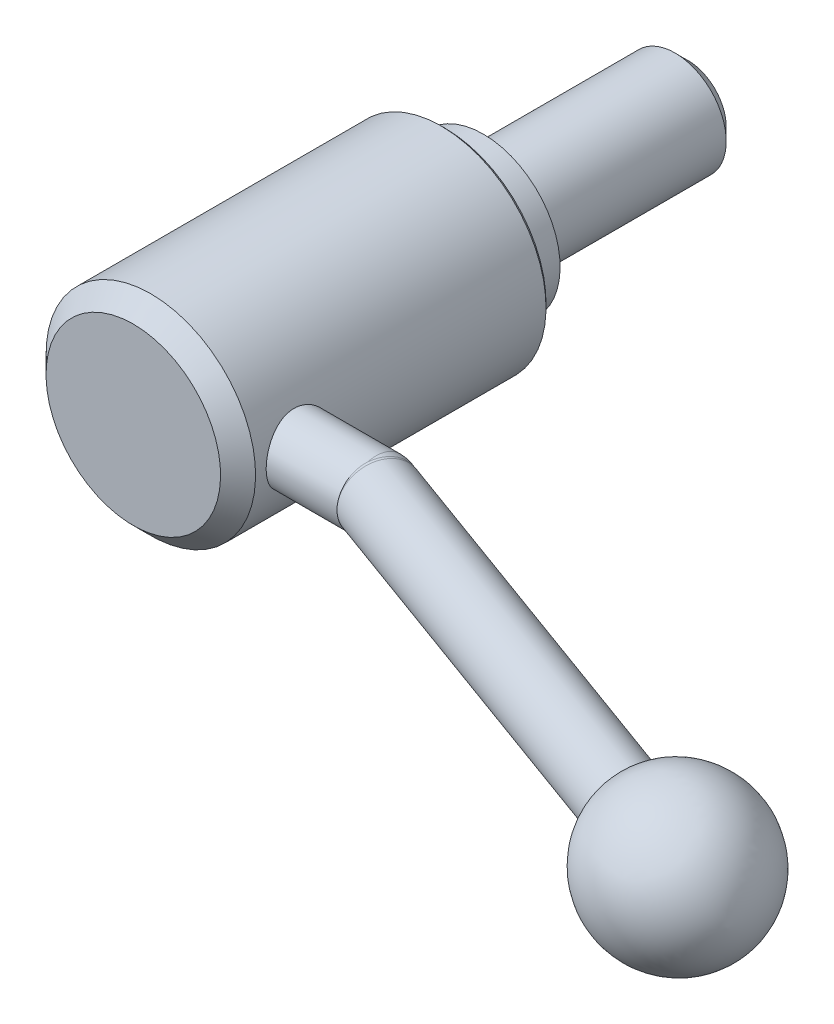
ISO-10303-21;
HEADER;
FILE_DESCRIPTION(('STEP AP214'),'2;1');
FILE_NAME('part.step','',(''),(''),'','','');
FILE_SCHEMA(('AUTOMOTIVE_DESIGN { 1 0 10303 214 1 1 1 1 }'));
ENDSEC;
DATA;
#1=APPLICATION_CONTEXT('core data for automotive mechanical design processes');
#2=APPLICATION_PROTOCOL_DEFINITION('international standard','automotive_design',2000,#1);
#3=PRODUCT_CONTEXT('',#1,'mechanical');
#4=PRODUCT('Part','Part','',(#3));
#5=PRODUCT_RELATED_PRODUCT_CATEGORY('part','',(#4));
#6=PRODUCT_DEFINITION_FORMATION('','',#4);
#7=PRODUCT_DEFINITION_CONTEXT('part definition',#1,'design');
#8=PRODUCT_DEFINITION('design','',#6,#7);
#9=PRODUCT_DEFINITION_SHAPE('','',#8);
#10=(LENGTH_UNIT() NAMED_UNIT(*) SI_UNIT(.MILLI.,.METRE.));
#11=(NAMED_UNIT(*) PLANE_ANGLE_UNIT() SI_UNIT($,.RADIAN.));
#12=(NAMED_UNIT(*) SI_UNIT($,.STERADIAN.) SOLID_ANGLE_UNIT());
#13=UNCERTAINTY_MEASURE_WITH_UNIT(LENGTH_MEASURE(1.E-05),#10,'distance_accuracy_value','');
#14=(GEOMETRIC_REPRESENTATION_CONTEXT(3) GLOBAL_UNCERTAINTY_ASSIGNED_CONTEXT((#13)) GLOBAL_UNIT_ASSIGNED_CONTEXT((#10,
#11,#12)) REPRESENTATION_CONTEXT('',''));
#15=CARTESIAN_POINT('',(0.,0.,0.));
#16=DIRECTION('',(0.,0.,1.));
#17=DIRECTION('',(1.,0.,0.));
#18=AXIS2_PLACEMENT_3D('',#15,#16,#17);
#19=CARTESIAN_POINT('',(0.,0.,0.));
#20=DIRECTION('',(0.,0.,-1.));
#21=DIRECTION('',(0.,1.,0.));
#22=AXIS2_PLACEMENT_3D('',#19,#20,#21);
#23=CYLINDRICAL_SURFACE('',#22,20.5);
#24=CARTESIAN_POINT('',(0.,0.,8.25));
#25=DIRECTION('',(0.,0.,-1.));
#26=DIRECTION('',(0.,1.,0.));
#27=AXIS2_PLACEMENT_3D('',#24,#25,#26);
#28=CIRCLE('',#27,20.5);
#29=CARTESIAN_POINT('',(0.,20.5,8.25));
#30=VERTEX_POINT('',#29);
#31=EDGE_CURVE('E147',#30,#30,#28,.T.);
#32=ORIENTED_EDGE('',*,*,#31,.F.);
#33=EDGE_LOOP('',(#32));
#34=FACE_BOUND('',#33,.T.);
#35=CARTESIAN_POINT('',(19.4422220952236,6.5,56.5));
#36=CARTESIAN_POINT('',(19.4422222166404,6.49999984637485,56.6775608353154));
#37=CARTESIAN_POINT('',(19.4446611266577,6.49271825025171,56.8551242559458));
#38=CARTESIAN_POINT('',(19.454338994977,6.46366201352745,57.2089295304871));
#39=CARTESIAN_POINT('',(19.4615780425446,6.44188710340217,57.3851713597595));
#40=CARTESIAN_POINT('',(19.4806268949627,6.38405046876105,57.7350468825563));
#41=CARTESIAN_POINT('',(19.4924368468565,6.34798828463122,57.9086804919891));
#42=CARTESIAN_POINT('',(19.5202654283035,6.26189122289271,58.2521641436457));
#43=CARTESIAN_POINT('',(19.5362855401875,6.2118514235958,58.4220128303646));
#44=CARTESIAN_POINT('',(19.5720112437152,6.09835258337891,58.7563693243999));
#45=CARTESIAN_POINT('',(19.5917092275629,6.03492120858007,58.9208873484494));
#46=CARTESIAN_POINT('',(19.6342385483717,5.89508386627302,59.2438952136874));
#47=CARTESIAN_POINT('',(19.6570700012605,5.8186774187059,59.4023848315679));
#48=CARTESIAN_POINT('',(19.7052295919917,5.65343532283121,59.7124029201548));
#49=CARTESIAN_POINT('',(19.7305584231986,5.5645962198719,59.8639294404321));
#50=CARTESIAN_POINT('',(19.7830095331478,5.37514542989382,60.159036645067));
#51=CARTESIAN_POINT('',(19.810131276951,5.27453724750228,60.3026196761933));
#52=CARTESIAN_POINT('',(19.8663573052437,5.05872294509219,60.5855845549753));
#53=CARTESIAN_POINT('',(19.8954973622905,4.94314912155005,60.7246789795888));
#54=CARTESIAN_POINT('',(19.9541229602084,4.70090397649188,60.9926738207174));
#55=CARTESIAN_POINT('',(19.9836083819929,4.57423638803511,61.1215776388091));
#56=CARTESIAN_POINT('',(20.0421539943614,4.31048905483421,61.3685042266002));
#57=CARTESIAN_POINT('',(20.071213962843,4.1734040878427,61.4865214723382));
#58=CARTESIAN_POINT('',(20.1281044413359,3.88977145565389,61.7107919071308));
#59=CARTESIAN_POINT('',(20.1559354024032,3.74322731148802,61.8170494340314));
#60=CARTESIAN_POINT('',(20.2102746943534,3.43793523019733,62.0195055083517));
#61=CARTESIAN_POINT('',(20.236735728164,3.2789797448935,62.1154041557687));
#62=CARTESIAN_POINT('',(20.2868421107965,2.95316588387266,62.2933802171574));
#63=CARTESIAN_POINT('',(20.3104885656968,2.786310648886,62.3754630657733));
#64=CARTESIAN_POINT('',(20.3543059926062,2.44575238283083,62.5251888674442));
#65=CARTESIAN_POINT('',(20.3744761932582,2.27204784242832,62.5928286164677));
#66=CARTESIAN_POINT('',(20.4107390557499,1.9191592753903,62.7130148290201));
#67=CARTESIAN_POINT('',(20.4268335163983,1.73997770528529,62.7655679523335));
#68=CARTESIAN_POINT('',(20.4540467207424,1.38310784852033,62.8537177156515));
#69=CARTESIAN_POINT('',(20.4653055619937,1.20554867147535,62.8897940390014));
#70=CARTESIAN_POINT('',(20.483240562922,0.847880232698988,62.9470057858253));
#71=CARTESIAN_POINT('',(20.489918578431,0.667772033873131,62.9681472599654));
#72=CARTESIAN_POINT('',(20.4985086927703,0.306306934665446,62.9953079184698));
#73=CARTESIAN_POINT('',(20.5004208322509,0.124950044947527,63.0013272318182));
#74=CARTESIAN_POINT('',(20.4994243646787,-0.237616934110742,62.9981845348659));
#75=CARTESIAN_POINT('',(20.4965158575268,-0.418827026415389,62.9890228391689));
#76=CARTESIAN_POINT('',(20.4861511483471,-0.773249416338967,62.9562077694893));
#77=CARTESIAN_POINT('',(20.4788613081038,-0.946515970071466,62.9330843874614));
#78=CARTESIAN_POINT('',(20.4600679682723,-1.29046183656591,62.8730051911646));
#79=CARTESIAN_POINT('',(20.4485630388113,-1.46114025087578,62.8360446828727));
#80=CARTESIAN_POINT('',(20.4216452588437,-1.798625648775,62.7486256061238));
#81=CARTESIAN_POINT('',(20.4062336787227,-1.9654338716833,62.6981714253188));
#82=CARTESIAN_POINT('',(20.3718916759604,-2.29420139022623,62.5841535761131));
#83=CARTESIAN_POINT('',(20.35295992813,-2.45615883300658,62.5205849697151));
#84=CARTESIAN_POINT('',(20.3118147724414,-2.77605889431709,62.3799991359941));
#85=CARTESIAN_POINT('',(20.2895645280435,-2.93392950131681,62.3028289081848));
#86=CARTESIAN_POINT('',(20.2425168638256,-3.24266972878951,62.1361230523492));
#87=CARTESIAN_POINT('',(20.2177185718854,-3.39353692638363,62.0465831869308));
#88=CARTESIAN_POINT('',(20.1662066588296,-3.68732340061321,61.8557751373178));
#89=CARTESIAN_POINT('',(20.1394929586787,-3.8302423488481,61.7545064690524));
#90=CARTESIAN_POINT('',(20.0848204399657,-4.10730208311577,61.5408997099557));
#91=CARTESIAN_POINT('',(20.0568615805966,-4.24144258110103,61.4285612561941));
#92=CARTESIAN_POINT('',(19.9991827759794,-4.50574800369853,61.1884400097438));
#93=CARTESIAN_POINT('',(19.9694388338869,-4.63549313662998,61.0602005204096));
#94=CARTESIAN_POINT('',(19.9101839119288,-4.88373422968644,60.7932909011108));
#95=CARTESIAN_POINT('',(19.8806728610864,-5.00223374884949,60.6546240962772));
#96=CARTESIAN_POINT('',(19.8226810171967,-5.22731613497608,60.3676143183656));
#97=CARTESIAN_POINT('',(19.7942007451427,-5.33389303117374,60.2192665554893));
#98=CARTESIAN_POINT('',(19.739110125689,-5.53428674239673,59.9139422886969));
#99=CARTESIAN_POINT('',(19.7124990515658,-5.62810852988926,59.7569691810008));
#100=CARTESIAN_POINT('',(19.6616069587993,-5.80341705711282,59.4333642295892));
#101=CARTESIAN_POINT('',(19.6373585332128,-5.88473833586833,59.2666375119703));
#102=CARTESIAN_POINT('',(19.5923338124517,-6.03294761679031,58.9265081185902));
#103=CARTESIAN_POINT('',(19.5715561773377,-6.09984119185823,58.7531080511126));
#104=CARTESIAN_POINT('',(19.5341361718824,-6.21863379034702,58.4008267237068));
#105=CARTESIAN_POINT('',(19.5174933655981,-6.2705343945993,58.2219460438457));
#106=CARTESIAN_POINT('',(19.4888985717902,-6.35885149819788,57.8600357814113));
#107=CARTESIAN_POINT('',(19.4769463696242,-6.39526870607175,57.6770063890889));
#108=CARTESIAN_POINT('',(19.4585313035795,-6.45107630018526,57.3158506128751));
#109=CARTESIAN_POINT('',(19.4518622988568,-6.47110721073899,57.1378335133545));
#110=CARTESIAN_POINT('',(19.443427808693,-6.49640633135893,56.7806394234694));
#111=CARTESIAN_POINT('',(19.4416621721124,-6.50167499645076,56.6014624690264));
#112=CARTESIAN_POINT('',(19.443091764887,-6.49739848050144,56.2433320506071));
#113=CARTESIAN_POINT('',(19.4462862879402,-6.48785540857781,56.0643785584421));
#114=CARTESIAN_POINT('',(19.4575309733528,-6.45405335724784,55.7080231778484));
#115=CARTESIAN_POINT('',(19.4655810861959,-6.4297945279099,55.5306212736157));
#116=CARTESIAN_POINT('',(19.4859636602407,-6.36775067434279,55.1840196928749));
#117=CARTESIAN_POINT('',(19.4981590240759,-6.33039761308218,55.0147343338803));
#118=CARTESIAN_POINT('',(19.5265148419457,-6.24238368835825,54.6799411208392));
#119=CARTESIAN_POINT('',(19.5426766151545,-6.19171839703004,54.5144345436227));
#120=CARTESIAN_POINT('',(19.5784935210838,-6.07751333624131,54.1883625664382));
#121=CARTESIAN_POINT('',(19.598147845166,-6.01397654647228,54.0277960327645));
#122=CARTESIAN_POINT('',(19.6404122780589,-5.87448001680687,53.7124890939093));
#123=CARTESIAN_POINT('',(19.663023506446,-5.79851556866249,53.5577509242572));
#124=CARTESIAN_POINT('',(19.711276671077,-5.63234141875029,53.2506795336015));
#125=CARTESIAN_POINT('',(19.7369874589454,-5.54178262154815,53.0985460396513));
#126=CARTESIAN_POINT('',(19.7901869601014,-5.34869406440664,52.8023330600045));
#127=CARTESIAN_POINT('',(19.8176762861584,-5.24616016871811,52.6582563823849));
#128=CARTESIAN_POINT('',(19.8736901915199,-5.02980339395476,52.3790447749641));
#129=CARTESIAN_POINT('',(19.9022148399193,-4.91597976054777,52.2439104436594));
#130=CARTESIAN_POINT('',(19.9595511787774,-4.67774787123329,51.9833824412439));
#131=CARTESIAN_POINT('',(19.9883628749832,-4.55333940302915,51.8579889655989));
#132=CARTESIAN_POINT('',(20.0467640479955,-4.28909489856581,51.612508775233));
#133=CARTESIAN_POINT('',(20.0763335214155,-4.14882502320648,51.4928837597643));
#134=CARTESIAN_POINT('',(20.1341446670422,-3.85851185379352,51.2658977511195));
#135=CARTESIAN_POINT('',(20.1623867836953,-3.70847187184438,51.1585326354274));
#136=CARTESIAN_POINT('',(20.2167791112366,-3.39947872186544,50.956751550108));
#137=CARTESIAN_POINT('',(20.2429285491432,-3.24052229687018,50.8623403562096));
#138=CARTESIAN_POINT('',(20.2923799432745,-2.91486277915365,50.6872782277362));
#139=CARTESIAN_POINT('',(20.31568308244,-2.74816294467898,50.606621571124));
#140=CARTESIAN_POINT('',(20.3586447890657,-2.40926409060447,50.4601915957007));
#141=CARTESIAN_POINT('',(20.3783271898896,-2.23711047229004,50.3943202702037));
#142=CARTESIAN_POINT('',(20.4136744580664,-1.88752303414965,50.2773627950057));
#143=CARTESIAN_POINT('',(20.4293409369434,-1.71009136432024,50.2262707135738));
#144=CARTESIAN_POINT('',(20.4562117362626,-1.35121271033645,50.1393152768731));
#145=CARTESIAN_POINT('',(20.4674163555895,-1.16976599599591,50.1034509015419));
#146=CARTESIAN_POINT('',(20.4850348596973,-0.804250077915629,50.0472977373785));
#147=CARTESIAN_POINT('',(20.4914489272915,-0.620180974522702,50.0270083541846));
#148=CARTESIAN_POINT('',(20.4991281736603,-0.258824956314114,50.0027406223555));
#149=CARTESIAN_POINT('',(20.5006028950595,-0.0815867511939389,49.9980984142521));
#150=CARTESIAN_POINT('',(20.4989516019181,0.272717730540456,50.0033067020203));
#151=CARTESIAN_POINT('',(20.4958240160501,0.449783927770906,50.0131621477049));
#152=CARTESIAN_POINT('',(20.4850529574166,0.802303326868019,50.0472753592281));
#153=CARTESIAN_POINT('',(20.477411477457,0.977757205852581,50.0715267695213));
#154=CARTESIAN_POINT('',(20.4578179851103,1.32593306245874,50.1342162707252));
#155=CARTESIAN_POINT('',(20.4458643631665,1.49865399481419,50.1726596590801));
#156=CARTESIAN_POINT('',(20.4181583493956,1.83775920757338,50.2627729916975));
#157=CARTESIAN_POINT('',(20.4024599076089,2.00419775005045,50.314255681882));
#158=CARTESIAN_POINT('',(20.3675799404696,2.33214296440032,50.430290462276));
#159=CARTESIAN_POINT('',(20.3483971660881,2.49364784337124,50.4948472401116));
#160=CARTESIAN_POINT('',(20.3070431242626,2.8106122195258,50.6365039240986));
#161=CARTESIAN_POINT('',(20.2848725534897,2.96607311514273,50.7136009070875));
#162=CARTESIAN_POINT('',(20.2380837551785,3.2701125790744,50.8798225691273));
#163=CARTESIAN_POINT('',(20.2134646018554,3.41868851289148,50.9689518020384));
#164=CARTESIAN_POINT('',(20.1615167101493,3.71299497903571,51.1618658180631));
#165=CARTESIAN_POINT('',(20.1341240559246,3.85845386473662,51.2660479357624));
#166=CARTESIAN_POINT('',(20.0780825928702,4.14019829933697,51.4859491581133));
#167=CARTESIAN_POINT('',(20.0494333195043,4.27648040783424,51.6016725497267));
#168=CARTESIAN_POINT('',(19.991639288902,4.5389891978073,51.8438784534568));
#169=CARTESIAN_POINT('',(19.9624945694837,4.66521664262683,51.9703601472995));
#170=CARTESIAN_POINT('',(19.9044649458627,4.90690637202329,52.2333644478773));
#171=CARTESIAN_POINT('',(19.8755801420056,5.0223646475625,52.3698907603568));
#172=CARTESIAN_POINT('',(19.8178815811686,5.24550327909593,52.6569714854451));
#173=CARTESIAN_POINT('',(19.7891042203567,5.35278119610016,52.8078463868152));
#174=CARTESIAN_POINT('',(19.7335121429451,5.55422553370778,53.118455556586));
#175=CARTESIAN_POINT('',(19.7066974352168,5.64839189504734,53.2781898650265));
#176=CARTESIAN_POINT('',(19.6558508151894,5.82286763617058,53.6054219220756));
#177=CARTESIAN_POINT('',(19.6318180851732,5.90318109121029,53.77291736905));
#178=CARTESIAN_POINT('',(19.5872824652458,6.04931454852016,54.1145638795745));
#179=CARTESIAN_POINT('',(19.5667793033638,6.11513566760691,54.2887144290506));
#180=CARTESIAN_POINT('',(19.5313806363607,6.22722680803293,54.6288485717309));
#181=CARTESIAN_POINT('',(19.5161756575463,6.27460911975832,54.7944341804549));
#182=CARTESIAN_POINT('',(19.4897776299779,6.35613148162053,55.1291406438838));
#183=CARTESIAN_POINT('',(19.4785842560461,6.39027260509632,55.2982612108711));
#184=CARTESIAN_POINT('',(19.4605385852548,6.44501906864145,55.6389039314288));
#185=CARTESIAN_POINT('',(19.4536861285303,6.46562490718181,55.8104259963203));
#186=CARTESIAN_POINT('',(19.4445285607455,6.49311322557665,56.1546314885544));
#187=CARTESIAN_POINT('',(19.4422219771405,6.50000014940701,56.3273145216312));
#188=CARTESIAN_POINT('',(19.4422220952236,6.5,56.5));
#189=B_SPLINE_CURVE_WITH_KNOTS('',3,(#35,#36,#37,#38,#39,#40,#41,#42,#43,#44,#45,#46,#47,#48,
#49,#50,#51,#52,#53,#54,#55,#56,#57,#58,#59,#60,#61,#62,#63,#64,#65,#66,#67,#68,#69,#70,#71,#72,
#73,#74,#75,#76,#77,#78,#79,#80,#81,#82,#83,#84,#85,#86,#87,#88,#89,#90,#91,#92,#93,#94,#95,#96,
#97,#98,#99,#100,#101,#102,#103,#104,#105,#106,#107,#108,#109,#110,#111,#112,#113,#114,#115,
#116,#117,#118,#119,#120,#121,#122,#123,#124,#125,#126,#127,#128,#129,#130,#131,#132,#133,#134,
#135,#136,#137,#138,#139,#140,#141,#142,#143,#144,#145,#146,#147,#148,#149,#150,#151,#152,#153,
#154,#155,#156,#157,#158,#159,#160,#161,#162,#163,#164,#165,#166,#167,#168,#169,#170,#171,#172,
#173,#174,#175,#176,#177,#178,#179,#180,#181,#182,#183,#184,#185,#186,#187,#188),.UNSPECIFIED.,
.T.,.F.,(4,2,2,2,2,2,2,2,2,2,2,2,2,2,2,2,2,2,2,2,2,2,2,2,2,2,2,2,2,2,2,2,2,2,2,2,2,2,2,2,2,2,2,
2,2,2,2,2,2,2,2,2,2,2,2,2,2,2,2,2,2,2,2,2,2,2,2,2,2,2,2,2,2,2,2,2,4),(0.,0.532521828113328,
1.06505355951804,1.5976024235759,2.13033904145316,2.66198564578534,3.19365192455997,
3.72546623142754,4.25712257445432,4.80602728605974,5.35474799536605,5.90374561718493,
6.45254004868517,7.0144069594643,7.5760523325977,8.13782217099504,8.6993436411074,
9.24327177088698,9.78697940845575,10.3306824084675,10.8743741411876,11.3986215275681,
11.9230469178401,12.4473019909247,12.9717548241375,13.5025350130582,14.0334974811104,
14.5644818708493,15.0954836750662,15.6493464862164,16.2030334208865,16.7569964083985,
17.3107428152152,17.8712831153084,18.4316065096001,18.991870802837,19.5521094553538,
20.0892329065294,20.6263398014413,21.163370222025,21.7003951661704,22.2211537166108,
22.7420856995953,23.2628972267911,23.7839065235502,24.3200181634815,24.8563155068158,
25.3926487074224,25.9289926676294,26.488454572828,27.0477277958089,27.6072066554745,
28.1664521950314,28.7218733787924,29.2770713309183,29.8322320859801,30.3873716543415,
30.9186402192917,31.4500902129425,31.9813057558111,32.512719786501,33.0368968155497,
33.5612621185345,34.0855053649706,34.6099475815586,35.1523480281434,35.6949507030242,
36.237512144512,36.7802747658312,37.3416479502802,37.9030236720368,38.4642339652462,
39.0254009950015,39.5435300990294,40.061617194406,40.579685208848,41.0975853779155),.UNSPECIFIED.);
#190=CARTESIAN_POINT('',(19.4422220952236,6.5,56.5));
#191=VERTEX_POINT('',#190);
#192=EDGE_CURVE('E77',#191,#191,#189,.T.);
#193=ORIENTED_EDGE('',*,*,#192,.F.);
#194=EDGE_LOOP('',(#193));
#195=FACE_BOUND('',#194,.T.);
#196=CARTESIAN_POINT('',(0.,0.,65.075));
#197=DIRECTION('',(0.,0.,-1.));
#198=DIRECTION('',(0.,1.,0.));
#199=AXIS2_PLACEMENT_3D('',#196,#197,#198);
#200=CIRCLE('',#199,20.5);
#201=CARTESIAN_POINT('',(0.,20.5,65.075));
#202=VERTEX_POINT('',#201);
#203=EDGE_CURVE('E149',#202,#202,#200,.T.);
#204=ORIENTED_EDGE('',*,*,#203,.T.);
#205=EDGE_LOOP('',(#204));
#206=FACE_BOUND('',#205,.T.);
#207=ADVANCED_FACE('F14',(#34,#195,#206),#23,.T.);
#208=CARTESIAN_POINT('',(0.,0.,68.5));
#209=DIRECTION('',(0.,0.,-1.));
#210=DIRECTION('',(0.,1.,0.));
#211=AXIS2_PLACEMENT_3D('',#208,#209,#210);
#212=PLANE('',#211);
#213=CARTESIAN_POINT('',(0.,0.,68.5));
#214=DIRECTION('',(0.,0.,-1.));
#215=DIRECTION('',(0.,1.,0.));
#216=AXIS2_PLACEMENT_3D('',#213,#214,#215);
#217=CIRCLE('',#216,17.075);
#218=CARTESIAN_POINT('',(0.,17.075,68.5));
#219=VERTEX_POINT('',#218);
#220=EDGE_CURVE('E85',#219,#219,#217,.T.);
#221=ORIENTED_EDGE('',*,*,#220,.F.);
#222=EDGE_LOOP('',(#221));
#223=FACE_BOUND('',#222,.T.);
#224=ADVANCED_FACE('F61',(#223),#212,.F.);
#225=CARTESIAN_POINT('',(0.,0.,68.5));
#226=DIRECTION('',(0.,0.,-1.));
#227=DIRECTION('',(0.,1.,0.));
#228=AXIS2_PLACEMENT_3D('',#225,#226,#227);
#229=CONICAL_SURFACE('',#228,17.075,0.785398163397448);
#230=ORIENTED_EDGE('',*,*,#203,.F.);
#231=EDGE_LOOP('',(#230));
#232=FACE_BOUND('',#231,.T.);
#233=ORIENTED_EDGE('',*,*,#220,.T.);
#234=EDGE_LOOP('',(#233));
#235=FACE_BOUND('',#234,.T.);
#236=ADVANCED_FACE('F67',(#232,#235),#229,.T.);
#237=CARTESIAN_POINT('',(0.,0.,8.25));
#238=DIRECTION('',(0.,0.,1.));
#239=DIRECTION('',(0.,-1.,0.));
#240=AXIS2_PLACEMENT_3D('',#237,#238,#239);
#241=CONICAL_SURFACE('',#240,20.5,0.785398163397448);
#242=CARTESIAN_POINT('',(0.,0.,7.5));
#243=DIRECTION('',(0.,0.,-1.));
#244=DIRECTION('',(0.,1.,0.));
#245=AXIS2_PLACEMENT_3D('',#242,#243,#244);
#246=CIRCLE('',#245,19.75);
#247=CARTESIAN_POINT('',(0.,19.75,7.5));
#248=VERTEX_POINT('',#247);
#249=EDGE_CURVE('E142',#248,#248,#246,.T.);
#250=ORIENTED_EDGE('',*,*,#249,.F.);
#251=EDGE_LOOP('',(#250));
#252=FACE_BOUND('',#251,.T.);
#253=ORIENTED_EDGE('',*,*,#31,.T.);
#254=EDGE_LOOP('',(#253));
#255=FACE_BOUND('',#254,.T.);
#256=ADVANCED_FACE('F74',(#252,#255),#241,.T.);
#257=CARTESIAN_POINT('',(19.75,0.,7.5));
#258=DIRECTION('',(0.,0.,1.));
#259=DIRECTION('',(0.,-1.,0.));
#260=AXIS2_PLACEMENT_3D('',#257,#258,#259);
#261=PLANE('',#260);
#262=CARTESIAN_POINT('',(0.,0.,7.5));
#263=DIRECTION('',(0.,0.,-1.));
#264=DIRECTION('',(0.,1.,0.));
#265=AXIS2_PLACEMENT_3D('',#262,#263,#264);
#266=CIRCLE('',#265,15.);
#267=CARTESIAN_POINT('',(0.,15.,7.5));
#268=VERTEX_POINT('',#267);
#269=EDGE_CURVE('E140',#268,#268,#266,.T.);
#270=ORIENTED_EDGE('',*,*,#269,.F.);
#271=EDGE_LOOP('',(#270));
#272=FACE_BOUND('',#271,.T.);
#273=ORIENTED_EDGE('',*,*,#249,.T.);
#274=EDGE_LOOP('',(#273));
#275=FACE_BOUND('',#274,.T.);
#276=ADVANCED_FACE('F161',(#272,#275),#261,.F.);
#277=CARTESIAN_POINT('',(0.,0.,0.));
#278=DIRECTION('',(0.,0.,-1.));
#279=DIRECTION('',(0.,1.,0.));
#280=AXIS2_PLACEMENT_3D('',#277,#278,#279);
#281=CYLINDRICAL_SURFACE('',#280,15.);
#282=CARTESIAN_POINT('',(0.,0.,0.));
#283=DIRECTION('',(0.,0.,-1.));
#284=DIRECTION('',(0.,1.,0.));
#285=AXIS2_PLACEMENT_3D('',#282,#283,#284);
#286=CIRCLE('',#285,15.);
#287=CARTESIAN_POINT('',(0.,15.,0.));
#288=VERTEX_POINT('',#287);
#289=EDGE_CURVE('E138',#288,#288,#286,.T.);
#290=ORIENTED_EDGE('',*,*,#289,.F.);
#291=EDGE_LOOP('',(#290));
#292=FACE_BOUND('',#291,.T.);
#293=ORIENTED_EDGE('',*,*,#269,.T.);
#294=EDGE_LOOP('',(#293));
#295=FACE_BOUND('',#294,.T.);
#296=ADVANCED_FACE('F135',(#292,#295),#281,.T.);
#297=CARTESIAN_POINT('',(15.,0.,0.));
#298=DIRECTION('',(0.,0.,1.));
#299=DIRECTION('',(0.,-1.,0.));
#300=AXIS2_PLACEMENT_3D('',#297,#298,#299);
#301=PLANE('',#300);
#302=CARTESIAN_POINT('',(0.,0.,0.));
#303=DIRECTION('',(0.,0.,-1.));
#304=DIRECTION('',(0.,1.,0.));
#305=AXIS2_PLACEMENT_3D('',#302,#303,#304);
#306=CIRCLE('',#305,10.);
#307=CARTESIAN_POINT('',(0.,10.,0.));
#308=VERTEX_POINT('',#307);
#309=EDGE_CURVE('E126',#308,#308,#306,.T.);
#310=ORIENTED_EDGE('',*,*,#309,.F.);
#311=EDGE_LOOP('',(#310));
#312=FACE_BOUND('',#311,.T.);
#313=ORIENTED_EDGE('',*,*,#289,.T.);
#314=EDGE_LOOP('',(#313));
#315=FACE_BOUND('',#314,.T.);
#316=ADVANCED_FACE('F93',(#312,#315),#301,.F.);
#317=CARTESIAN_POINT('',(42.,0.,56.5));
#318=DIRECTION('',(1.,0.,0.));
#319=DIRECTION('',(0.,1.,0.));
#320=AXIS2_PLACEMENT_3D('',#317,#318,#319);
#321=CYLINDRICAL_SURFACE('',#320,6.5);
#322=CARTESIAN_POINT('',(35.5002,-6.28048269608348,58.1749737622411));
#323=CARTESIAN_POINT('',(35.4701911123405,-6.2584855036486,58.2574684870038));
#324=CARTESIAN_POINT('',(35.4414052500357,-6.23475002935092,58.3399237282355));
#325=CARTESIAN_POINT('',(35.3859523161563,-6.18381246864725,58.5044625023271));
#326=CARTESIAN_POINT('',(35.3592849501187,-6.15661086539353,58.5865460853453));
#327=CARTESIAN_POINT('',(35.2819864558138,-6.06984393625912,58.8317442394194));
#328=CARTESIAN_POINT('',(35.2340264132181,-6.00509209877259,58.9938982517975));
#329=CARTESIAN_POINT('',(35.1437652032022,-5.8621289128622,59.3135555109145));
#330=CARTESIAN_POINT('',(35.1014588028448,-5.78393016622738,59.471062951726));
#331=CARTESIAN_POINT('',(35.0215196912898,-5.61443273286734,59.7801227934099));
#332=CARTESIAN_POINT('',(34.9838873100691,-5.5231331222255,59.9316747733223));
#333=CARTESIAN_POINT('',(34.9127228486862,-5.32805112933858,60.2273614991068));
#334=CARTESIAN_POINT('',(34.8791877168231,-5.22427815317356,60.371501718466));
#335=CARTESIAN_POINT('',(34.8157745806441,-5.00483968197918,60.6512875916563));
#336=CARTESIAN_POINT('',(34.7858966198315,-4.88917404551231,60.7869331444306));
#337=CARTESIAN_POINT('',(34.7295154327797,-4.64671898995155,61.048605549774));
#338=CARTESIAN_POINT('',(34.7030116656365,-4.51993135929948,61.1746339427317));
#339=CARTESIAN_POINT('',(34.6531671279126,-4.25605741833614,61.4160918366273));
#340=CARTESIAN_POINT('',(34.6298263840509,-4.11897102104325,61.5315212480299));
#341=CARTESIAN_POINT('',(34.5859306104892,-3.83395076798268,61.7520111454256));
#342=CARTESIAN_POINT('',(34.5654071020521,-3.68591886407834,61.8569512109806));
#343=CARTESIAN_POINT('',(34.5273160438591,-3.38127311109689,62.0542722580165));
#344=CARTESIAN_POINT('',(34.5097495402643,-3.22465625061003,62.1466487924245));
#345=CARTESIAN_POINT('',(34.4775004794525,-2.90402878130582,62.3180456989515));
#346=CARTESIAN_POINT('',(34.4628174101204,-2.74001949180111,62.3970684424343));
#347=CARTESIAN_POINT('',(34.4362651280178,-2.4056942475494,62.5411738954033));
#348=CARTESIAN_POINT('',(34.424396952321,-2.23537599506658,62.606251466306));
#349=CARTESIAN_POINT('',(34.4035252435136,-1.89117431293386,62.7214241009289));
#350=CARTESIAN_POINT('',(34.3944984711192,-1.71733288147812,62.7716404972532));
#351=CARTESIAN_POINT('',(34.3791416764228,-1.36588965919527,62.8574425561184));
#352=CARTESIAN_POINT('',(34.3728126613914,-1.18828648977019,62.8930227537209));
#353=CARTESIAN_POINT('',(34.3628391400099,-0.830755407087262,62.9492305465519));
#354=CARTESIAN_POINT('',(34.3591931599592,-0.650828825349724,62.9698663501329));
#355=CARTESIAN_POINT('',(34.3545680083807,-0.289765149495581,62.996061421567));
#356=CARTESIAN_POINT('',(34.3535900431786,-0.108627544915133,63.0016138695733));
#357=CARTESIAN_POINT('',(34.3542996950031,0.252555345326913,62.9975893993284));
#358=CARTESIAN_POINT('',(34.355973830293,0.43260151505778,62.9880890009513));
#359=CARTESIAN_POINT('',(34.361966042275,0.791157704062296,62.9541833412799));
#360=CARTESIAN_POINT('',(34.3662829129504,0.969668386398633,62.9297848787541));
#361=CARTESIAN_POINT('',(34.377575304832,1.32405576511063,62.8662625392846));
#362=CARTESIAN_POINT('',(34.3845521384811,1.49993111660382,62.8271313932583));
#363=CARTESIAN_POINT('',(34.4011832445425,1.847645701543,62.7344660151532));
#364=CARTESIAN_POINT('',(34.4108365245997,2.01948640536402,62.6809371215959));
#365=CARTESIAN_POINT('',(34.4328583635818,2.35804742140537,62.5598634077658));
#366=CARTESIAN_POINT('',(34.4452278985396,2.52476586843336,62.4923135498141));
#367=CARTESIAN_POINT('',(34.472721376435,2.85178734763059,62.3437616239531));
#368=CARTESIAN_POINT('',(34.4878443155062,3.01209269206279,62.2627644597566));
#369=CARTESIAN_POINT('',(34.5209144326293,3.32526997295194,62.0879110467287));
#370=CARTESIAN_POINT('',(34.538862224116,3.47814028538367,61.9940520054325));
#371=CARTESIAN_POINT('',(34.5776589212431,3.77530504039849,61.7942532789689));
#372=CARTESIAN_POINT('',(34.5985068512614,3.9196023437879,61.6883176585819));
#373=CARTESIAN_POINT('',(34.6433408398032,4.199419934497,61.4645872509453));
#374=CARTESIAN_POINT('',(34.6673426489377,4.33489069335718,61.3467336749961));
#375=CARTESIAN_POINT('',(34.7185603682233,4.59531298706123,61.1005655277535));
#376=CARTESIAN_POINT('',(34.7457763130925,4.72026440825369,60.9722508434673));
#377=CARTESIAN_POINT('',(34.8036465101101,4.95882988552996,60.70617837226));
#378=CARTESIAN_POINT('',(34.8343011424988,5.07244268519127,60.5684195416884));
#379=CARTESIAN_POINT('',(34.8993555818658,5.28757920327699,60.2846019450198));
#380=CARTESIAN_POINT('',(34.9337552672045,5.38910331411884,60.1385434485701));
#381=CARTESIAN_POINT('',(35.0048466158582,5.57448375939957,59.8471450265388));
#382=CARTESIAN_POINT('',(35.0413260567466,5.65898432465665,59.7021627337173));
#383=CARTESIAN_POINT('',(35.1186048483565,5.81610839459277,59.4070309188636));
#384=CARTESIAN_POINT('',(35.1594036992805,5.88873327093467,59.2568819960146));
#385=CARTESIAN_POINT('',(35.2461889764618,6.02181290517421,58.9526179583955));
#386=CARTESIAN_POINT('',(35.2921778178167,6.08226196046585,58.798501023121));
#387=CARTESIAN_POINT('',(35.3660624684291,6.16360062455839,58.5656236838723));
#388=CARTESIAN_POINT('',(35.3915152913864,6.18916346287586,58.4876924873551));
#389=CARTESIAN_POINT('',(35.4443438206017,6.23716716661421,58.3315099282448));
#390=CARTESIAN_POINT('',(35.4717197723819,6.25960763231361,58.2532585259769));
#391=CARTESIAN_POINT('',(35.5001999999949,6.28048269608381,58.17497376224));
#392=B_SPLINE_CURVE_WITH_KNOTS('',3,(#322,#323,#324,#325,#326,#327,#328,#329,#330,#331,#332,
#333,#334,#335,#336,#337,#338,#339,#340,#341,#342,#343,#344,#345,#346,#347,#348,#349,#350,#351,
#352,#353,#354,#355,#356,#357,#358,#359,#360,#361,#362,#363,#364,#365,#366,#367,#368,#369,#370,
#371,#372,#373,#374,#375,#376,#377,#378,#379,#380,#381,#382,#383,#384,#385,#386,#387,#388,#389,
#390,#391),.UNSPECIFIED.,.F.,.F.,(4,2,2,2,2,2,2,2,2,2,2,2,2,2,2,2,2,2,2,2,2,2,2,2,2,2,2,2,2,2,2,
2,2,2,4),(0.,0.271433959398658,0.542830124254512,1.08532167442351,1.62730757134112,
2.16933170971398,2.71094964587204,3.25257402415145,3.79411146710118,4.33565348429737,
4.88283172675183,5.43020315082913,5.97747727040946,6.52495270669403,7.06782653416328,
7.61090287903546,8.15368070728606,8.6967039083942,9.2369755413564,9.77700080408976,
10.3172928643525,10.8573848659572,11.3976712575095,11.9377610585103,12.4779683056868,
13.0179942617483,13.5608276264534,14.1036668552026,14.6465661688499,15.189447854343,
15.7040975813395,16.2186878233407,16.7335185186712,16.99107618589,17.2486667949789),.UNSPECIFIED.);
#393=CARTESIAN_POINT('',(35.5,-6.28033613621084,58.1755232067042));
#394=VERTEX_POINT('',#393);
#395=CARTESIAN_POINT('',(34.3538746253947,0.,63.));
#396=VERTEX_POINT('',#395);
#397=EDGE_CURVE('E29',#394,#396,#392,.T.);
#398=ORIENTED_EDGE('',*,*,#397,.T.);
#399=CARTESIAN_POINT('',(35.5,6.28033613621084,58.1755232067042));
#400=VERTEX_POINT('',#399);
#401=EDGE_CURVE('E98',#396,#400,#392,.T.);
#402=ORIENTED_EDGE('',*,*,#401,.T.);
#403=CARTESIAN_POINT('',(35.5,0.,56.5));
#404=DIRECTION('',(1.,0.,0.));
#405=DIRECTION('',(0.,1.,0.));
#406=AXIS2_PLACEMENT_3D('',#403,#404,#405);
#407=CIRCLE('',#406,6.5);
#408=EDGE_CURVE('E107',#394,#400,#407,.T.);
#409=ORIENTED_EDGE('',*,*,#408,.F.);
#410=EDGE_LOOP('',(#398,#402,#409));
#411=FACE_BOUND('',#410,.T.);
#412=ORIENTED_EDGE('',*,*,#192,.T.);
#413=EDGE_LOOP('',(#412));
#414=FACE_BOUND('',#413,.T.);
#415=ADVANCED_FACE('F87',(#411,#414),#321,.T.);
#416=CARTESIAN_POINT('',(35.5,0.,56.5));
#417=DIRECTION('',(1.,0.,0.));
#418=DIRECTION('',(0.,0.,-1.));
#419=AXIS2_PLACEMENT_3D('',#416,#417,#418);
#420=SPHERICAL_SURFACE('',#419,6.5);
#421=CARTESIAN_POINT('',(36.0385027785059,0.,56.6959989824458));
#422=DIRECTION('',(0.93969262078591,0.,0.342020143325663));
#423=DIRECTION('',(-0.342020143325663,0.,0.939692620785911));
#424=AXIS2_PLACEMENT_3D('',#421,#422,#423);
#425=CIRCLE('',#424,6.4746891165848);
#426=EDGE_CURVE('E36',#394,#400,#425,.T.);
#427=ORIENTED_EDGE('',*,*,#426,.F.);
#428=ORIENTED_EDGE('',*,*,#408,.T.);
#429=EDGE_LOOP('',(#427,#428));
#430=FACE_BOUND('',#429,.T.);
#431=ADVANCED_FACE('F92',(#430),#420,.T.);
#432=CARTESIAN_POINT('',(36.5770055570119,0.,56.8919979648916));
#433=DIRECTION('',(0.939692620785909,0.,0.342020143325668));
#434=DIRECTION('',(-0.342020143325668,0.,0.939692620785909));
#435=AXIS2_PLACEMENT_3D('',#432,#433,#434);
#436=SPHERICAL_SURFACE('',#435,6.5);
#437=ORIENTED_EDGE('',*,*,#397,.F.);
#438=ORIENTED_EDGE('',*,*,#426,.T.);
#439=ORIENTED_EDGE('',*,*,#401,.F.);
#440=CARTESIAN_POINT('',(36.5770055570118,0.,56.8919979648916));
#441=DIRECTION('',(0.939692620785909,0.,0.342020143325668));
#442=DIRECTION('',(-0.342020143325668,0.,0.939692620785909));
#443=AXIS2_PLACEMENT_3D('',#440,#441,#442);
#444=CIRCLE('',#443,6.5);
#445=EDGE_CURVE('E105',#396,#396,#444,.T.);
#446=ORIENTED_EDGE('',*,*,#445,.F.);
#447=EDGE_LOOP('',(#437,#438,#439,#446));
#448=FACE_BOUND('',#447,.T.);
#449=ADVANCED_FACE('F109',(#448),#436,.T.);
#450=CARTESIAN_POINT('',(143.243431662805,0.,95.7154020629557));
#451=DIRECTION('',(0.939692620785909,0.,0.342020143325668));
#452=DIRECTION('',(-0.342020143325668,0.,0.939692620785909));
#453=AXIS2_PLACEMENT_3D('',#450,#451,#452);
#454=CYLINDRICAL_SURFACE('',#453,6.5);
#455=CARTESIAN_POINT('',(116.198996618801,0.,85.8720327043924));
#456=DIRECTION('',(0.939692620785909,0.,0.342020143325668));
#457=DIRECTION('',(-0.342020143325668,0.,0.939692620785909));
#458=AXIS2_PLACEMENT_3D('',#455,#456,#457);
#459=CIRCLE('',#458,6.5);
#460=CARTESIAN_POINT('',(113.975865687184,0.,91.9800347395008));
#461=VERTEX_POINT('',#460);
#462=EDGE_CURVE('E121',#461,#461,#459,.T.);
#463=ORIENTED_EDGE('',*,*,#462,.F.);
#464=EDGE_LOOP('',(#463));
#465=FACE_BOUND('',#464,.T.);
#466=ORIENTED_EDGE('',*,*,#445,.T.);
#467=EDGE_LOOP('',(#466));
#468=FACE_BOUND('',#467,.T.);
#469=ADVANCED_FACE('F56',(#465,#468),#454,.T.);
#470=CARTESIAN_POINT('',(113.975865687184,0.,91.9800347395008));
#471=DIRECTION('',(0.939692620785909,0.,0.342020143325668));
#472=DIRECTION('',(-0.342020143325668,0.,0.939692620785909));
#473=AXIS2_PLACEMENT_3D('',#470,#471,#472);
#474=PLANE('',#473);
#475=CARTESIAN_POINT('',(116.198996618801,0.,85.8720327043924));
#476=DIRECTION('',(0.939692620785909,0.,0.342020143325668));
#477=DIRECTION('',(-0.342020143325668,0.,0.939692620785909));
#478=AXIS2_PLACEMENT_3D('',#475,#476,#477);
#479=CIRCLE('',#478,8.80198315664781);
#480=CARTESIAN_POINT('',(113.188541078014,0.,94.1431913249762));
#481=VERTEX_POINT('',#480);
#482=EDGE_CURVE('E124',#481,#481,#479,.T.);
#483=ORIENTED_EDGE('',*,*,#482,.F.);
#484=EDGE_LOOP('',(#483));
#485=FACE_BOUND('',#484,.T.);
#486=ORIENTED_EDGE('',*,*,#462,.T.);
#487=EDGE_LOOP('',(#486));
#488=FACE_BOUND('',#487,.T.);
#489=ADVANCED_FACE('F45',(#485,#488),#474,.F.);
#490=CARTESIAN_POINT('',(128.5,0.,89.5));
#491=DIRECTION('',(0.,1.,0.));
#492=DIRECTION('',(-0.342020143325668,0.,0.939692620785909));
#493=AXIS2_PLACEMENT_3D('',#490,#491,#492);
#494=CIRCLE('',#493,16.);
#495=TRIMMED_CURVE('',#494,(PARAMETER_VALUE(-1.52089957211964)),
(PARAMETER_VALUE(1.52089957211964)),.T.,.PARAMETER.);
#496=CARTESIAN_POINT('',(128.22706216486,0.,90.2498905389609));
#497=DIRECTION('',(0.939692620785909,0.,0.342020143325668));
#498=AXIS1_PLACEMENT('',#496,#497);
#499=SURFACE_OF_REVOLUTION('',#495,#498);
#500=ORIENTED_EDGE('',*,*,#482,.T.);
#501=EDGE_LOOP('',(#500));
#502=FACE_BOUND('',#501,.T.);
#503=CARTESIAN_POINT('',(143.243431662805,0.,95.7154020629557));
#504=VERTEX_POINT('',#503);
#505=VERTEX_LOOP('',#504);
#506=FACE_BOUND('',#505,.T.);
#507=ADVANCED_FACE('F42',(#502,#506),#499,.T.);
#508=CARTESIAN_POINT('',(0.,0.,27.));
#509=DIRECTION('',(0.,0.,-1.));
#510=DIRECTION('',(-1.,0.,0.));
#511=AXIS2_PLACEMENT_3D('',#508,#509,#510);
#512=CYLINDRICAL_SURFACE('',#511,10.);
#513=CARTESIAN_POINT('',(0.,0.,-37.5));
#514=DIRECTION('',(0.,0.,-1.));
#515=DIRECTION('',(-1.,0.,0.));
#516=AXIS2_PLACEMENT_3D('',#513,#514,#515);
#517=CIRCLE('',#516,10.);
#518=CARTESIAN_POINT('',(-10.,0.,-37.5));
#519=VERTEX_POINT('',#518);
#520=EDGE_CURVE('E9',#519,#519,#517,.F.);
#521=ORIENTED_EDGE('',*,*,#520,.T.);
#522=EDGE_LOOP('',(#521));
#523=FACE_BOUND('',#522,.T.);
#524=ORIENTED_EDGE('',*,*,#309,.T.);
#525=EDGE_LOOP('',(#524));
#526=FACE_BOUND('',#525,.T.);
#527=ADVANCED_FACE('F44',(#523,#526),#512,.T.);
#528=CARTESIAN_POINT('',(0.,0.,-40.));
#529=DIRECTION('',(0.,0.,-1.));
#530=DIRECTION('',(-1.,0.,0.));
#531=AXIS2_PLACEMENT_3D('',#528,#529,#530);
#532=PLANE('',#531);
#533=CARTESIAN_POINT('',(0.,0.,-40.));
#534=DIRECTION('',(0.,0.,-1.));
#535=DIRECTION('',(-1.,0.,0.));
#536=AXIS2_PLACEMENT_3D('',#533,#534,#535);
#537=CIRCLE('',#536,7.5);
#538=CARTESIAN_POINT('',(-7.5,0.,-40.));
#539=VERTEX_POINT('',#538);
#540=EDGE_CURVE('E22',#539,#539,#537,.T.);
#541=ORIENTED_EDGE('',*,*,#540,.T.);
#542=EDGE_LOOP('',(#541));
#543=FACE_BOUND('',#542,.T.);
#544=ADVANCED_FACE('F53',(#543),#532,.T.);
#545=CARTESIAN_POINT('',(0.,0.,-40.));
#546=DIRECTION('',(0.,0.,1.));
#547=DIRECTION('',(1.,0.,0.));
#548=AXIS2_PLACEMENT_3D('',#545,#546,#547);
#549=CONICAL_SURFACE('',#548,7.5,0.785398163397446);
#550=ORIENTED_EDGE('',*,*,#520,.F.);
#551=EDGE_LOOP('',(#550));
#552=FACE_BOUND('',#551,.T.);
#553=ORIENTED_EDGE('',*,*,#540,.F.);
#554=EDGE_LOOP('',(#553));
#555=FACE_BOUND('',#554,.T.);
#556=ADVANCED_FACE('F16',(#552,#555),#549,.T.);
#557=CLOSED_SHELL('',(#207,#224,#236,#256,#276,#296,#316,#415,#431,#449,#469,#489,#507,#527,
#544,#556));
#558=MANIFOLD_SOLID_BREP('B1',#557);
#559=ADVANCED_BREP_SHAPE_REPRESENTATION('',(#18,#558),#14);
#560=SHAPE_DEFINITION_REPRESENTATION(#9,#559);
ENDSEC;
END-ISO-10303-21;
